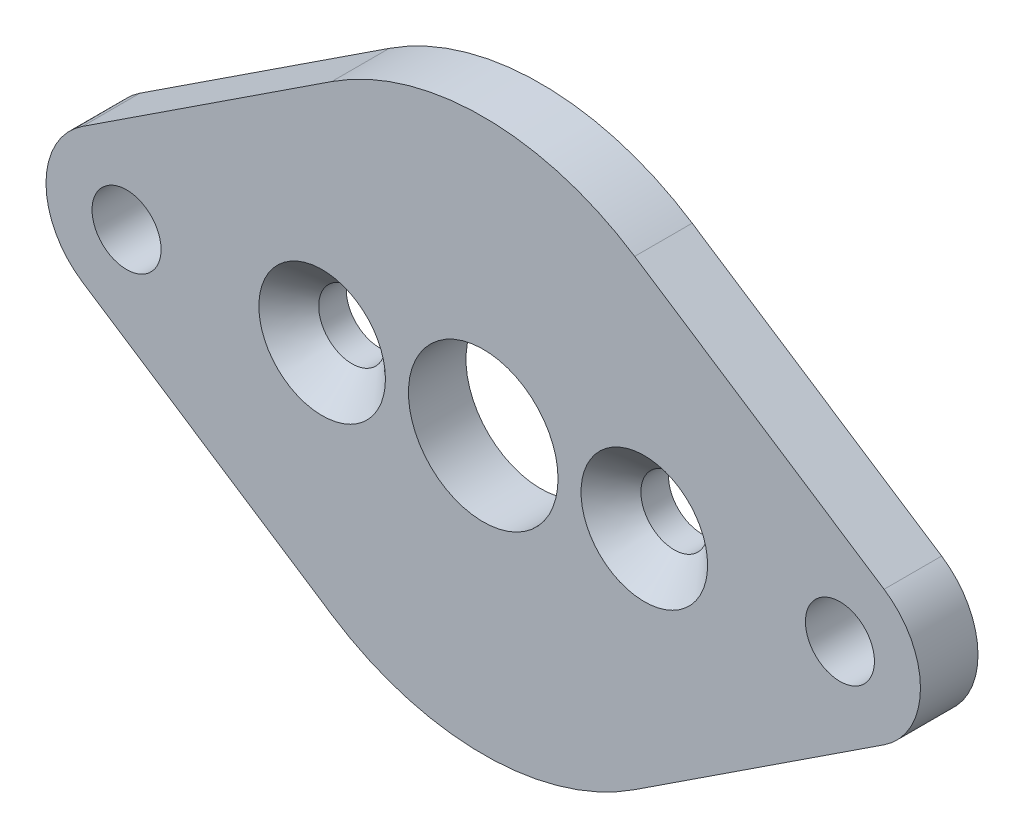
ISO-10303-21;
HEADER;
FILE_DESCRIPTION(('STEP AP214'),'2;1');
FILE_NAME('part.step','',(''),(''),'','','');
FILE_SCHEMA(('AUTOMOTIVE_DESIGN { 1 0 10303 214 1 1 1 1 }'));
ENDSEC;
DATA;
#1=APPLICATION_CONTEXT('core data for automotive mechanical design processes');
#2=APPLICATION_PROTOCOL_DEFINITION('international standard','automotive_design',2000,#1);
#3=PRODUCT_CONTEXT('',#1,'mechanical');
#4=PRODUCT('Part','Part','',(#3));
#5=PRODUCT_RELATED_PRODUCT_CATEGORY('part','',(#4));
#6=PRODUCT_DEFINITION_FORMATION('','',#4);
#7=PRODUCT_DEFINITION_CONTEXT('part definition',#1,'design');
#8=PRODUCT_DEFINITION('design','',#6,#7);
#9=PRODUCT_DEFINITION_SHAPE('','',#8);
#10=(LENGTH_UNIT() NAMED_UNIT(*) SI_UNIT(.MILLI.,.METRE.));
#11=(NAMED_UNIT(*) PLANE_ANGLE_UNIT() SI_UNIT($,.RADIAN.));
#12=(NAMED_UNIT(*) SI_UNIT($,.STERADIAN.) SOLID_ANGLE_UNIT());
#13=UNCERTAINTY_MEASURE_WITH_UNIT(LENGTH_MEASURE(1.E-05),#10,'distance_accuracy_value','');
#14=(GEOMETRIC_REPRESENTATION_CONTEXT(3) GLOBAL_UNCERTAINTY_ASSIGNED_CONTEXT((#13)) GLOBAL_UNIT_ASSIGNED_CONTEXT((#10,
#11,#12)) REPRESENTATION_CONTEXT('',''));
#15=CARTESIAN_POINT('',(0.,0.,0.));
#16=DIRECTION('',(0.,0.,1.));
#17=DIRECTION('',(1.,0.,0.));
#18=AXIS2_PLACEMENT_3D('',#15,#16,#17);
#19=CARTESIAN_POINT('',(-15.5,0.,2.5));
#20=DIRECTION('',(0.,0.,1.));
#21=DIRECTION('',(1.,0.,0.));
#22=AXIS2_PLACEMENT_3D('',#19,#20,#21);
#23=PLANE('',#22);
#24=CARTESIAN_POINT('',(-7.,0.,2.5));
#25=DIRECTION('',(0.,0.,1.));
#26=DIRECTION('',(1.,0.,0.));
#27=AXIS2_PLACEMENT_3D('',#24,#25,#26);
#28=CIRCLE('',#27,2.75);
#29=CARTESIAN_POINT('',(-4.25,0.,2.5));
#30=VERTEX_POINT('',#29);
#31=EDGE_CURVE('E241',#30,#30,#28,.T.);
#32=ORIENTED_EDGE('',*,*,#31,.F.);
#33=EDGE_LOOP('',(#32));
#34=FACE_BOUND('',#33,.T.);
#35=CARTESIAN_POINT('',(7.,0.,2.5));
#36=DIRECTION('',(0.,0.,1.));
#37=DIRECTION('',(1.,0.,0.));
#38=AXIS2_PLACEMENT_3D('',#35,#36,#37);
#39=CIRCLE('',#38,2.75);
#40=CARTESIAN_POINT('',(9.75,0.,2.5));
#41=VERTEX_POINT('',#40);
#42=EDGE_CURVE('E253',#41,#41,#39,.T.);
#43=ORIENTED_EDGE('',*,*,#42,.F.);
#44=EDGE_LOOP('',(#43));
#45=FACE_BOUND('',#44,.T.);
#46=CARTESIAN_POINT('',(-15.5,0.,2.5));
#47=DIRECTION('',(0.,0.,1.));
#48=DIRECTION('',(1.,0.,0.));
#49=AXIS2_PLACEMENT_3D('',#46,#47,#48);
#50=CIRCLE('',#49,1.5);
#51=CARTESIAN_POINT('',(-14.,0.,2.5));
#52=VERTEX_POINT('',#51);
#53=EDGE_CURVE('E265',#52,#52,#50,.T.);
#54=ORIENTED_EDGE('',*,*,#53,.F.);
#55=EDGE_LOOP('',(#54));
#56=FACE_BOUND('',#55,.T.);
#57=CARTESIAN_POINT('',(-15.5,0.,2.5));
#58=DIRECTION('',(0.,0.,1.));
#59=DIRECTION('',(1.,0.,0.));
#60=AXIS2_PLACEMENT_3D('',#57,#58,#59);
#61=CIRCLE('',#60,3.5);
#62=CARTESIAN_POINT('',(-17.4193548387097,2.92678612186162,2.5));
#63=VERTEX_POINT('',#62);
#64=CARTESIAN_POINT('',(-17.4193548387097,-2.92678612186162,2.5));
#65=VERTEX_POINT('',#64);
#66=EDGE_CURVE('E136',#63,#65,#61,.T.);
#67=ORIENTED_EDGE('',*,*,#66,.T.);
#68=DIRECTION('',(0.836224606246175,-0.548387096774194,0.));
#69=VECTOR('',#68,1.);
#70=CARTESIAN_POINT('',(-17.4193548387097,-2.92678612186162,2.5));
#71=LINE('',#70,#69);
#72=CARTESIAN_POINT('',(-6.58064516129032,-10.0346952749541,2.5));
#73=VERTEX_POINT('',#72);
#74=EDGE_CURVE('E113',#65,#73,#71,.T.);
#75=ORIENTED_EDGE('',*,*,#74,.T.);
#76=CARTESIAN_POINT('',(0.,0.,2.5));
#77=DIRECTION('',(0.,0.,1.));
#78=DIRECTION('',(1.,0.,0.));
#79=AXIS2_PLACEMENT_3D('',#76,#77,#78);
#80=CIRCLE('',#79,12.);
#81=CARTESIAN_POINT('',(6.58064516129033,-10.0346952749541,2.5));
#82=VERTEX_POINT('',#81);
#83=EDGE_CURVE('E139',#73,#82,#80,.T.);
#84=ORIENTED_EDGE('',*,*,#83,.T.);
#85=DIRECTION('',(0.836224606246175,0.548387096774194,0.));
#86=VECTOR('',#85,1.);
#87=CARTESIAN_POINT('',(17.4193548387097,-2.92678612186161,2.5));
#88=LINE('',#87,#86);
#89=CARTESIAN_POINT('',(17.4193548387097,-2.92678612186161,2.5));
#90=VERTEX_POINT('',#89);
#91=EDGE_CURVE('E141',#82,#90,#88,.T.);
#92=ORIENTED_EDGE('',*,*,#91,.T.);
#93=CARTESIAN_POINT('',(15.5,0.,2.5));
#94=DIRECTION('',(0.,0.,1.));
#95=DIRECTION('',(1.,0.,0.));
#96=AXIS2_PLACEMENT_3D('',#93,#94,#95);
#97=CIRCLE('',#96,3.5);
#98=CARTESIAN_POINT('',(17.4193548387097,2.92678612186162,2.5));
#99=VERTEX_POINT('',#98);
#100=EDGE_CURVE('E143',#90,#99,#97,.T.);
#101=ORIENTED_EDGE('',*,*,#100,.T.);
#102=DIRECTION('',(-0.836224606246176,0.548387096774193,0.));
#103=VECTOR('',#102,1.);
#104=CARTESIAN_POINT('',(6.58064516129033,10.0346952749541,2.5));
#105=LINE('',#104,#103);
#106=CARTESIAN_POINT('',(6.58064516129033,10.0346952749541,2.5));
#107=VERTEX_POINT('',#106);
#108=EDGE_CURVE('E145',#99,#107,#105,.T.);
#109=ORIENTED_EDGE('',*,*,#108,.T.);
#110=CARTESIAN_POINT('',(0.,0.,2.5));
#111=DIRECTION('',(0.,0.,1.));
#112=DIRECTION('',(1.,0.,0.));
#113=AXIS2_PLACEMENT_3D('',#110,#111,#112);
#114=CIRCLE('',#113,12.);
#115=CARTESIAN_POINT('',(-6.58064516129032,10.0346952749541,2.5));
#116=VERTEX_POINT('',#115);
#117=EDGE_CURVE('E54',#107,#116,#114,.T.);
#118=ORIENTED_EDGE('',*,*,#117,.T.);
#119=DIRECTION('',(-0.836224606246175,-0.548387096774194,0.));
#120=VECTOR('',#119,1.);
#121=CARTESIAN_POINT('',(-17.4193548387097,2.92678612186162,2.5));
#122=LINE('',#121,#120);
#123=EDGE_CURVE('E49',#116,#63,#122,.T.);
#124=ORIENTED_EDGE('',*,*,#123,.T.);
#125=EDGE_LOOP('',(#67,#75,#84,#92,#101,#109,#118,#124));
#126=FACE_BOUND('',#125,.T.);
#127=CARTESIAN_POINT('',(0.,0.,2.5));
#128=DIRECTION('',(0.,0.,1.));
#129=DIRECTION('',(1.,0.,0.));
#130=AXIS2_PLACEMENT_3D('',#127,#128,#129);
#131=CIRCLE('',#130,3.25);
#132=CARTESIAN_POINT('',(3.25,0.,2.5));
#133=VERTEX_POINT('',#132);
#134=EDGE_CURVE('E118',#133,#133,#131,.T.);
#135=ORIENTED_EDGE('',*,*,#134,.F.);
#136=EDGE_LOOP('',(#135));
#137=FACE_BOUND('',#136,.T.);
#138=CARTESIAN_POINT('',(15.5,0.,2.5));
#139=DIRECTION('',(0.,0.,1.));
#140=DIRECTION('',(1.,0.,0.));
#141=AXIS2_PLACEMENT_3D('',#138,#139,#140);
#142=CIRCLE('',#141,1.5);
#143=CARTESIAN_POINT('',(17.,0.,2.5));
#144=VERTEX_POINT('',#143);
#145=EDGE_CURVE('E259',#144,#144,#142,.T.);
#146=ORIENTED_EDGE('',*,*,#145,.F.);
#147=EDGE_LOOP('',(#146));
#148=FACE_BOUND('',#147,.T.);
#149=ADVANCED_FACE('F34',(#34,#45,#56,#126,#137,#148),#23,.T.);
#150=CARTESIAN_POINT('',(-15.5,0.,0.));
#151=DIRECTION('',(0.,0.,1.));
#152=DIRECTION('',(1.,0.,0.));
#153=AXIS2_PLACEMENT_3D('',#150,#151,#152);
#154=PLANE('',#153);
#155=CARTESIAN_POINT('',(-7.,0.,0.));
#156=DIRECTION('',(0.,0.,1.));
#157=DIRECTION('',(1.,0.,0.));
#158=AXIS2_PLACEMENT_3D('',#155,#156,#157);
#159=CIRCLE('',#158,1.45);
#160=CARTESIAN_POINT('',(-5.55,0.,0.));
#161=VERTEX_POINT('',#160);
#162=EDGE_CURVE('E237',#161,#161,#159,.T.);
#163=ORIENTED_EDGE('',*,*,#162,.T.);
#164=EDGE_LOOP('',(#163));
#165=FACE_BOUND('',#164,.T.);
#166=CARTESIAN_POINT('',(7.,0.,0.));
#167=DIRECTION('',(0.,0.,1.));
#168=DIRECTION('',(1.,0.,0.));
#169=AXIS2_PLACEMENT_3D('',#166,#167,#168);
#170=CIRCLE('',#169,1.45);
#171=CARTESIAN_POINT('',(8.45,0.,0.));
#172=VERTEX_POINT('',#171);
#173=EDGE_CURVE('E244',#172,#172,#170,.T.);
#174=ORIENTED_EDGE('',*,*,#173,.T.);
#175=EDGE_LOOP('',(#174));
#176=FACE_BOUND('',#175,.T.);
#177=CARTESIAN_POINT('',(-15.5,0.,0.));
#178=DIRECTION('',(0.,0.,1.));
#179=DIRECTION('',(1.,0.,0.));
#180=AXIS2_PLACEMENT_3D('',#177,#178,#179);
#181=CIRCLE('',#180,1.5);
#182=CARTESIAN_POINT('',(-14.,0.,0.));
#183=VERTEX_POINT('',#182);
#184=EDGE_CURVE('E262',#183,#183,#181,.T.);
#185=ORIENTED_EDGE('',*,*,#184,.T.);
#186=EDGE_LOOP('',(#185));
#187=FACE_BOUND('',#186,.T.);
#188=CARTESIAN_POINT('',(-15.5,0.,0.));
#189=DIRECTION('',(0.,0.,1.));
#190=DIRECTION('',(1.,0.,0.));
#191=AXIS2_PLACEMENT_3D('',#188,#189,#190);
#192=CIRCLE('',#191,3.5);
#193=CARTESIAN_POINT('',(-17.4193548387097,2.92678612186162,0.));
#194=VERTEX_POINT('',#193);
#195=CARTESIAN_POINT('',(-17.4193548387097,-2.92678612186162,0.));
#196=VERTEX_POINT('',#195);
#197=EDGE_CURVE('E104',#194,#196,#192,.T.);
#198=ORIENTED_EDGE('',*,*,#197,.F.);
#199=DIRECTION('',(-0.836224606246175,-0.548387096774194,0.));
#200=VECTOR('',#199,1.);
#201=CARTESIAN_POINT('',(-17.4193548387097,2.92678612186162,0.));
#202=LINE('',#201,#200);
#203=CARTESIAN_POINT('',(-6.58064516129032,10.0346952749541,0.));
#204=VERTEX_POINT('',#203);
#205=EDGE_CURVE('E134',#204,#194,#202,.T.);
#206=ORIENTED_EDGE('',*,*,#205,.F.);
#207=CARTESIAN_POINT('',(0.,0.,0.));
#208=DIRECTION('',(0.,0.,1.));
#209=DIRECTION('',(1.,0.,0.));
#210=AXIS2_PLACEMENT_3D('',#207,#208,#209);
#211=CIRCLE('',#210,12.);
#212=CARTESIAN_POINT('',(6.58064516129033,10.0346952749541,0.));
#213=VERTEX_POINT('',#212);
#214=EDGE_CURVE('E132',#213,#204,#211,.T.);
#215=ORIENTED_EDGE('',*,*,#214,.F.);
#216=DIRECTION('',(-0.836224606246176,0.548387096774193,0.));
#217=VECTOR('',#216,1.);
#218=CARTESIAN_POINT('',(6.58064516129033,10.0346952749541,0.));
#219=LINE('',#218,#217);
#220=CARTESIAN_POINT('',(17.4193548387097,2.92678612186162,0.));
#221=VERTEX_POINT('',#220);
#222=EDGE_CURVE('E130',#221,#213,#219,.T.);
#223=ORIENTED_EDGE('',*,*,#222,.F.);
#224=CARTESIAN_POINT('',(15.5,0.,0.));
#225=DIRECTION('',(0.,0.,1.));
#226=DIRECTION('',(1.,0.,0.));
#227=AXIS2_PLACEMENT_3D('',#224,#225,#226);
#228=CIRCLE('',#227,3.5);
#229=CARTESIAN_POINT('',(17.4193548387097,-2.92678612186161,0.));
#230=VERTEX_POINT('',#229);
#231=EDGE_CURVE('E128',#230,#221,#228,.T.);
#232=ORIENTED_EDGE('',*,*,#231,.F.);
#233=DIRECTION('',(0.836224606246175,0.548387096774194,0.));
#234=VECTOR('',#233,1.);
#235=CARTESIAN_POINT('',(17.4193548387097,-2.92678612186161,0.));
#236=LINE('',#235,#234);
#237=CARTESIAN_POINT('',(6.58064516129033,-10.0346952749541,0.));
#238=VERTEX_POINT('',#237);
#239=EDGE_CURVE('E126',#238,#230,#236,.T.);
#240=ORIENTED_EDGE('',*,*,#239,.F.);
#241=CARTESIAN_POINT('',(0.,0.,0.));
#242=DIRECTION('',(0.,0.,1.));
#243=DIRECTION('',(1.,0.,0.));
#244=AXIS2_PLACEMENT_3D('',#241,#242,#243);
#245=CIRCLE('',#244,12.);
#246=CARTESIAN_POINT('',(-6.58064516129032,-10.0346952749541,0.));
#247=VERTEX_POINT('',#246);
#248=EDGE_CURVE('E106',#247,#238,#245,.T.);
#249=ORIENTED_EDGE('',*,*,#248,.F.);
#250=DIRECTION('',(0.836224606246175,-0.548387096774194,0.));
#251=VECTOR('',#250,1.);
#252=CARTESIAN_POINT('',(-17.4193548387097,-2.92678612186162,0.));
#253=LINE('',#252,#251);
#254=EDGE_CURVE('E99',#196,#247,#253,.T.);
#255=ORIENTED_EDGE('',*,*,#254,.F.);
#256=EDGE_LOOP('',(#198,#206,#215,#223,#232,#240,#249,#255));
#257=FACE_BOUND('',#256,.T.);
#258=CARTESIAN_POINT('',(0.,0.,0.));
#259=DIRECTION('',(0.,0.,1.));
#260=DIRECTION('',(1.,0.,0.));
#261=AXIS2_PLACEMENT_3D('',#258,#259,#260);
#262=CIRCLE('',#261,3.25);
#263=CARTESIAN_POINT('',(3.25,0.,0.));
#264=VERTEX_POINT('',#263);
#265=EDGE_CURVE('E121',#264,#264,#262,.T.);
#266=ORIENTED_EDGE('',*,*,#265,.T.);
#267=EDGE_LOOP('',(#266));
#268=FACE_BOUND('',#267,.T.);
#269=CARTESIAN_POINT('',(15.5,0.,0.));
#270=DIRECTION('',(0.,0.,1.));
#271=DIRECTION('',(1.,0.,0.));
#272=AXIS2_PLACEMENT_3D('',#269,#270,#271);
#273=CIRCLE('',#272,1.5);
#274=CARTESIAN_POINT('',(17.,0.,0.));
#275=VERTEX_POINT('',#274);
#276=EDGE_CURVE('E256',#275,#275,#273,.T.);
#277=ORIENTED_EDGE('',*,*,#276,.T.);
#278=EDGE_LOOP('',(#277));
#279=FACE_BOUND('',#278,.T.);
#280=ADVANCED_FACE('F100',(#165,#176,#187,#257,#268,#279),#154,.F.);
#281=CARTESIAN_POINT('',(-15.5,0.,2.5));
#282=DIRECTION('',(0.,0.,-1.));
#283=DIRECTION('',(-1.,0.,0.));
#284=AXIS2_PLACEMENT_3D('',#281,#282,#283);
#285=CYLINDRICAL_SURFACE('',#284,3.5);
#286=ORIENTED_EDGE('',*,*,#197,.T.);
#287=DIRECTION('',(0.,0.,-1.));
#288=VECTOR('',#287,1.);
#289=CARTESIAN_POINT('',(-17.4193548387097,-2.92678612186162,2.5));
#290=LINE('',#289,#288);
#291=EDGE_CURVE('E11',#65,#196,#290,.T.);
#292=ORIENTED_EDGE('',*,*,#291,.F.);
#293=ORIENTED_EDGE('',*,*,#66,.F.);
#294=DIRECTION('',(0.,0.,-1.));
#295=VECTOR('',#294,1.);
#296=CARTESIAN_POINT('',(-17.4193548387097,2.92678612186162,2.5));
#297=LINE('',#296,#295);
#298=EDGE_CURVE('E117',#63,#194,#297,.T.);
#299=ORIENTED_EDGE('',*,*,#298,.T.);
#300=EDGE_LOOP('',(#286,#292,#293,#299));
#301=FACE_BOUND('',#300,.T.);
#302=ADVANCED_FACE('F36',(#301),#285,.T.);
#303=CARTESIAN_POINT('',(-17.4193548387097,-2.92678612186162,2.5));
#304=DIRECTION('',(0.548387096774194,0.836224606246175,0.));
#305=DIRECTION('',(-0.836224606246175,0.548387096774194,0.));
#306=AXIS2_PLACEMENT_3D('',#303,#304,#305);
#307=PLANE('',#306);
#308=ORIENTED_EDGE('',*,*,#254,.T.);
#309=DIRECTION('',(0.,0.,-1.));
#310=VECTOR('',#309,1.);
#311=CARTESIAN_POINT('',(-6.58064516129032,-10.0346952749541,2.5));
#312=LINE('',#311,#310);
#313=EDGE_CURVE('E42',#73,#247,#312,.T.);
#314=ORIENTED_EDGE('',*,*,#313,.F.);
#315=ORIENTED_EDGE('',*,*,#74,.F.);
#316=ORIENTED_EDGE('',*,*,#291,.T.);
#317=EDGE_LOOP('',(#308,#314,#315,#316));
#318=FACE_BOUND('',#317,.T.);
#319=ADVANCED_FACE('F112',(#318),#307,.F.);
#320=CARTESIAN_POINT('',(0.,0.,2.5));
#321=DIRECTION('',(0.,0.,-1.));
#322=DIRECTION('',(-1.,0.,0.));
#323=AXIS2_PLACEMENT_3D('',#320,#321,#322);
#324=CYLINDRICAL_SURFACE('',#323,12.);
#325=ORIENTED_EDGE('',*,*,#248,.T.);
#326=DIRECTION('',(0.,0.,-1.));
#327=VECTOR('',#326,1.);
#328=CARTESIAN_POINT('',(6.58064516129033,-10.0346952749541,2.5));
#329=LINE('',#328,#327);
#330=EDGE_CURVE('E162',#82,#238,#329,.T.);
#331=ORIENTED_EDGE('',*,*,#330,.F.);
#332=ORIENTED_EDGE('',*,*,#83,.F.);
#333=ORIENTED_EDGE('',*,*,#313,.T.);
#334=EDGE_LOOP('',(#325,#331,#332,#333));
#335=FACE_BOUND('',#334,.T.);
#336=ADVANCED_FACE('F166',(#335),#324,.T.);
#337=CARTESIAN_POINT('',(17.4193548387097,-2.92678612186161,2.5));
#338=DIRECTION('',(-0.548387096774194,0.836224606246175,0.));
#339=DIRECTION('',(-0.836224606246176,-0.548387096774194,0.));
#340=AXIS2_PLACEMENT_3D('',#337,#338,#339);
#341=PLANE('',#340);
#342=ORIENTED_EDGE('',*,*,#239,.T.);
#343=DIRECTION('',(0.,0.,-1.));
#344=VECTOR('',#343,1.);
#345=CARTESIAN_POINT('',(17.4193548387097,-2.92678612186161,2.5));
#346=LINE('',#345,#344);
#347=EDGE_CURVE('E159',#90,#230,#346,.T.);
#348=ORIENTED_EDGE('',*,*,#347,.F.);
#349=ORIENTED_EDGE('',*,*,#91,.F.);
#350=ORIENTED_EDGE('',*,*,#330,.T.);
#351=EDGE_LOOP('',(#342,#348,#349,#350));
#352=FACE_BOUND('',#351,.T.);
#353=ADVANCED_FACE('F174',(#352),#341,.F.);
#354=CARTESIAN_POINT('',(15.5,0.,2.5));
#355=DIRECTION('',(0.,0.,-1.));
#356=DIRECTION('',(-1.,0.,0.));
#357=AXIS2_PLACEMENT_3D('',#354,#355,#356);
#358=CYLINDRICAL_SURFACE('',#357,3.5);
#359=ORIENTED_EDGE('',*,*,#231,.T.);
#360=DIRECTION('',(0.,0.,-1.));
#361=VECTOR('',#360,1.);
#362=CARTESIAN_POINT('',(17.4193548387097,2.92678612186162,2.5));
#363=LINE('',#362,#361);
#364=EDGE_CURVE('E156',#99,#221,#363,.T.);
#365=ORIENTED_EDGE('',*,*,#364,.F.);
#366=ORIENTED_EDGE('',*,*,#100,.F.);
#367=ORIENTED_EDGE('',*,*,#347,.T.);
#368=EDGE_LOOP('',(#359,#365,#366,#367));
#369=FACE_BOUND('',#368,.T.);
#370=ADVANCED_FACE('F177',(#369),#358,.T.);
#371=CARTESIAN_POINT('',(6.58064516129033,10.0346952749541,2.5));
#372=DIRECTION('',(-0.548387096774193,-0.836224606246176,0.));
#373=DIRECTION('',(0.836224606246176,-0.548387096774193,0.));
#374=AXIS2_PLACEMENT_3D('',#371,#372,#373);
#375=PLANE('',#374);
#376=ORIENTED_EDGE('',*,*,#222,.T.);
#377=DIRECTION('',(0.,0.,-1.));
#378=VECTOR('',#377,1.);
#379=CARTESIAN_POINT('',(6.58064516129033,10.0346952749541,2.5));
#380=LINE('',#379,#378);
#381=EDGE_CURVE('E153',#107,#213,#380,.T.);
#382=ORIENTED_EDGE('',*,*,#381,.F.);
#383=ORIENTED_EDGE('',*,*,#108,.F.);
#384=ORIENTED_EDGE('',*,*,#364,.T.);
#385=EDGE_LOOP('',(#376,#382,#383,#384));
#386=FACE_BOUND('',#385,.T.);
#387=ADVANCED_FACE('F182',(#386),#375,.F.);
#388=CARTESIAN_POINT('',(0.,0.,2.5));
#389=DIRECTION('',(0.,0.,-1.));
#390=DIRECTION('',(-1.,0.,0.));
#391=AXIS2_PLACEMENT_3D('',#388,#389,#390);
#392=CYLINDRICAL_SURFACE('',#391,12.);
#393=ORIENTED_EDGE('',*,*,#214,.T.);
#394=DIRECTION('',(0.,0.,-1.));
#395=VECTOR('',#394,1.);
#396=CARTESIAN_POINT('',(-6.58064516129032,10.0346952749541,2.5));
#397=LINE('',#396,#395);
#398=EDGE_CURVE('E150',#116,#204,#397,.T.);
#399=ORIENTED_EDGE('',*,*,#398,.F.);
#400=ORIENTED_EDGE('',*,*,#117,.F.);
#401=ORIENTED_EDGE('',*,*,#381,.T.);
#402=EDGE_LOOP('',(#393,#399,#400,#401));
#403=FACE_BOUND('',#402,.T.);
#404=ADVANCED_FACE('F185',(#403),#392,.T.);
#405=CARTESIAN_POINT('',(-17.4193548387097,2.92678612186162,2.5));
#406=DIRECTION('',(0.548387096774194,-0.836224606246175,0.));
#407=DIRECTION('',(0.836224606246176,0.548387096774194,0.));
#408=AXIS2_PLACEMENT_3D('',#405,#406,#407);
#409=PLANE('',#408);
#410=ORIENTED_EDGE('',*,*,#205,.T.);
#411=ORIENTED_EDGE('',*,*,#298,.F.);
#412=ORIENTED_EDGE('',*,*,#123,.F.);
#413=ORIENTED_EDGE('',*,*,#398,.T.);
#414=EDGE_LOOP('',(#410,#411,#412,#413));
#415=FACE_BOUND('',#414,.T.);
#416=ADVANCED_FACE('F187',(#415),#409,.F.);
#417=CARTESIAN_POINT('',(0.,0.,2.5));
#418=DIRECTION('',(0.,0.,-1.));
#419=DIRECTION('',(-1.,0.,0.));
#420=AXIS2_PLACEMENT_3D('',#417,#418,#419);
#421=CYLINDRICAL_SURFACE('',#420,3.25);
#422=ORIENTED_EDGE('',*,*,#134,.T.);
#423=EDGE_LOOP('',(#422));
#424=FACE_BOUND('',#423,.T.);
#425=ORIENTED_EDGE('',*,*,#265,.F.);
#426=EDGE_LOOP('',(#425));
#427=FACE_BOUND('',#426,.T.);
#428=ADVANCED_FACE('F189',(#424,#427),#421,.F.);
#429=CARTESIAN_POINT('',(-15.5,0.,2.5));
#430=DIRECTION('',(0.,0.,-1.));
#431=DIRECTION('',(-1.,0.,0.));
#432=AXIS2_PLACEMENT_3D('',#429,#430,#431);
#433=CYLINDRICAL_SURFACE('',#432,1.5);
#434=ORIENTED_EDGE('',*,*,#53,.T.);
#435=EDGE_LOOP('',(#434));
#436=FACE_BOUND('',#435,.T.);
#437=ORIENTED_EDGE('',*,*,#184,.F.);
#438=EDGE_LOOP('',(#437));
#439=FACE_BOUND('',#438,.T.);
#440=ADVANCED_FACE('F195',(#436,#439),#433,.F.);
#441=CARTESIAN_POINT('',(15.5,0.,2.5));
#442=DIRECTION('',(0.,0.,-1.));
#443=DIRECTION('',(-1.,0.,0.));
#444=AXIS2_PLACEMENT_3D('',#441,#442,#443);
#445=CYLINDRICAL_SURFACE('',#444,1.5);
#446=ORIENTED_EDGE('',*,*,#145,.T.);
#447=EDGE_LOOP('',(#446));
#448=FACE_BOUND('',#447,.T.);
#449=ORIENTED_EDGE('',*,*,#276,.F.);
#450=EDGE_LOOP('',(#449));
#451=FACE_BOUND('',#450,.T.);
#452=ADVANCED_FACE('F212',(#448,#451),#445,.F.);
#453=CARTESIAN_POINT('',(7.,0.,2.5));
#454=DIRECTION('',(0.,0.,1.));
#455=DIRECTION('',(1.,0.,0.));
#456=AXIS2_PLACEMENT_3D('',#453,#454,#455);
#457=CONICAL_SURFACE('',#456,2.75,0.785398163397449);
#458=CARTESIAN_POINT('',(7.,0.,1.2));
#459=DIRECTION('',(0.,0.,1.));
#460=DIRECTION('',(1.,0.,0.));
#461=AXIS2_PLACEMENT_3D('',#458,#459,#460);
#462=CIRCLE('',#461,1.45);
#463=CARTESIAN_POINT('',(8.45,0.,1.2));
#464=VERTEX_POINT('',#463);
#465=EDGE_CURVE('E250',#464,#464,#462,.T.);
#466=ORIENTED_EDGE('',*,*,#465,.F.);
#467=EDGE_LOOP('',(#466));
#468=FACE_BOUND('',#467,.T.);
#469=ORIENTED_EDGE('',*,*,#42,.T.);
#470=EDGE_LOOP('',(#469));
#471=FACE_BOUND('',#470,.T.);
#472=ADVANCED_FACE('F216',(#468,#471),#457,.F.);
#473=CARTESIAN_POINT('',(7.,0.,2.5));
#474=DIRECTION('',(0.,0.,1.));
#475=DIRECTION('',(1.,0.,0.));
#476=AXIS2_PLACEMENT_3D('',#473,#474,#475);
#477=CYLINDRICAL_SURFACE('',#476,1.45);
#478=ORIENTED_EDGE('',*,*,#173,.F.);
#479=EDGE_LOOP('',(#478));
#480=FACE_BOUND('',#479,.T.);
#481=ORIENTED_EDGE('',*,*,#465,.T.);
#482=EDGE_LOOP('',(#481));
#483=FACE_BOUND('',#482,.T.);
#484=ADVANCED_FACE('F220',(#480,#483),#477,.F.);
#485=CARTESIAN_POINT('',(-7.,0.,2.5));
#486=DIRECTION('',(0.,0.,1.));
#487=DIRECTION('',(1.,0.,0.));
#488=AXIS2_PLACEMENT_3D('',#485,#486,#487);
#489=CONICAL_SURFACE('',#488,2.75,0.785398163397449);
#490=CARTESIAN_POINT('',(-7.,0.,1.2));
#491=DIRECTION('',(0.,0.,1.));
#492=DIRECTION('',(1.,0.,0.));
#493=AXIS2_PLACEMENT_3D('',#490,#491,#492);
#494=CIRCLE('',#493,1.45);
#495=CARTESIAN_POINT('',(-5.55,0.,1.2));
#496=VERTEX_POINT('',#495);
#497=EDGE_CURVE('E240',#496,#496,#494,.T.);
#498=ORIENTED_EDGE('',*,*,#497,.F.);
#499=EDGE_LOOP('',(#498));
#500=FACE_BOUND('',#499,.T.);
#501=ORIENTED_EDGE('',*,*,#31,.T.);
#502=EDGE_LOOP('',(#501));
#503=FACE_BOUND('',#502,.T.);
#504=ADVANCED_FACE('F224',(#500,#503),#489,.F.);
#505=CARTESIAN_POINT('',(-7.,0.,2.5));
#506=DIRECTION('',(0.,0.,1.));
#507=DIRECTION('',(1.,0.,0.));
#508=AXIS2_PLACEMENT_3D('',#505,#506,#507);
#509=CYLINDRICAL_SURFACE('',#508,1.45);
#510=ORIENTED_EDGE('',*,*,#162,.F.);
#511=EDGE_LOOP('',(#510));
#512=FACE_BOUND('',#511,.T.);
#513=ORIENTED_EDGE('',*,*,#497,.T.);
#514=EDGE_LOOP('',(#513));
#515=FACE_BOUND('',#514,.T.);
#516=ADVANCED_FACE('F228',(#512,#515),#509,.F.);
#517=CLOSED_SHELL('',(#149,#280,#302,#319,#336,#353,#370,#387,#404,#416,#428,#440,#452,#472,
#484,#504,#516));
#518=MANIFOLD_SOLID_BREP('B2',#517);
#519=ADVANCED_BREP_SHAPE_REPRESENTATION('',(#18,#518),#14);
#520=SHAPE_DEFINITION_REPRESENTATION(#9,#519);
ENDSEC;
END-ISO-10303-21;
